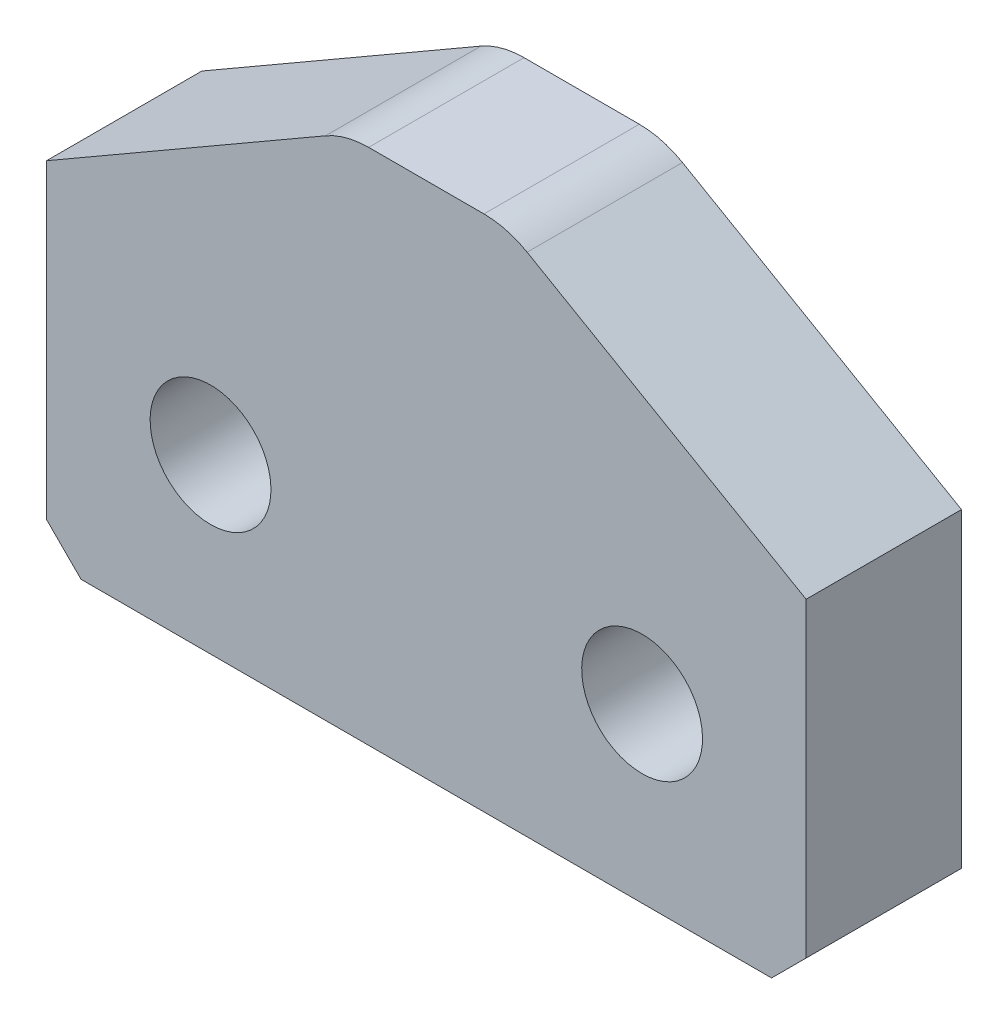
ISO-10303-21;
HEADER;
FILE_DESCRIPTION(('STEP AP214'),'2;1');
FILE_NAME('part.step','',(''),(''),'','','');
FILE_SCHEMA(('AUTOMOTIVE_DESIGN { 1 0 10303 214 1 1 1 1 }'));
ENDSEC;
DATA;
#1=APPLICATION_CONTEXT('core data for automotive mechanical design processes');
#2=APPLICATION_PROTOCOL_DEFINITION('international standard','automotive_design',2000,#1);
#3=PRODUCT_CONTEXT('',#1,'mechanical');
#4=PRODUCT('Part','Part','',(#3));
#5=PRODUCT_RELATED_PRODUCT_CATEGORY('part','',(#4));
#6=PRODUCT_DEFINITION_FORMATION('','',#4);
#7=PRODUCT_DEFINITION_CONTEXT('part definition',#1,'design');
#8=PRODUCT_DEFINITION('design','',#6,#7);
#9=PRODUCT_DEFINITION_SHAPE('','',#8);
#10=(LENGTH_UNIT() NAMED_UNIT(*) SI_UNIT(.MILLI.,.METRE.));
#11=(NAMED_UNIT(*) PLANE_ANGLE_UNIT() SI_UNIT($,.RADIAN.));
#12=(NAMED_UNIT(*) SI_UNIT($,.STERADIAN.) SOLID_ANGLE_UNIT());
#13=UNCERTAINTY_MEASURE_WITH_UNIT(LENGTH_MEASURE(1.E-05),#10,'distance_accuracy_value','');
#14=(GEOMETRIC_REPRESENTATION_CONTEXT(3) GLOBAL_UNCERTAINTY_ASSIGNED_CONTEXT((#13)) GLOBAL_UNIT_ASSIGNED_CONTEXT((#10,
#11,#12)) REPRESENTATION_CONTEXT('',''));
#15=CARTESIAN_POINT('',(0.,0.,0.));
#16=DIRECTION('',(0.,0.,1.));
#17=DIRECTION('',(1.,0.,0.));
#18=AXIS2_PLACEMENT_3D('',#15,#16,#17);
#19=CARTESIAN_POINT('',(15.8397459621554,15.,9.));
#20=DIRECTION('',(0.,0.,1.));
#21=DIRECTION('',(0.,-1.,0.));
#22=AXIS2_PLACEMENT_3D('',#19,#20,#21);
#23=PLANE('',#22);
#24=CARTESIAN_POINT('',(0.,0.,9.));
#25=DIRECTION('',(0.,0.,1.));
#26=DIRECTION('',(0.,-1.,0.));
#27=AXIS2_PLACEMENT_3D('',#24,#25,#26);
#28=CIRCLE('',#27,3.5);
#29=CARTESIAN_POINT('',(0.,-3.5,9.));
#30=VERTEX_POINT('',#29);
#31=EDGE_CURVE('E105',#30,#30,#28,.T.);
#32=ORIENTED_EDGE('',*,*,#31,.F.);
#33=EDGE_LOOP('',(#32));
#34=FACE_BOUND('',#33,.T.);
#35=DIRECTION('',(1.,0.,0.));
#36=VECTOR('',#35,1.);
#37=CARTESIAN_POINT('',(-7.5,-10.,9.));
#38=LINE('',#37,#36);
#39=CARTESIAN_POINT('',(-7.5,-10.,9.));
#40=VERTEX_POINT('',#39);
#41=CARTESIAN_POINT('',(32.5,-10.,9.));
#42=VERTEX_POINT('',#41);
#43=EDGE_CURVE('E136',#40,#42,#38,.T.);
#44=ORIENTED_EDGE('',*,*,#43,.T.);
#45=DIRECTION('',(-0.707106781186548,-0.707106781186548,0.));
#46=VECTOR('',#45,1.);
#47=CARTESIAN_POINT('',(34.5,-8.,9.));
#48=LINE('',#47,#46);
#49=CARTESIAN_POINT('',(34.5,-8.,9.));
#50=VERTEX_POINT('',#49);
#51=EDGE_CURVE('E97',#50,#42,#48,.T.);
#52=ORIENTED_EDGE('',*,*,#51,.F.);
#53=DIRECTION('',(0.,1.,0.));
#54=VECTOR('',#53,1.);
#55=CARTESIAN_POINT('',(34.5,-8.,9.));
#56=LINE('',#55,#54);
#57=CARTESIAN_POINT('',(34.5,10.,9.));
#58=VERTEX_POINT('',#57);
#59=EDGE_CURVE('E139',#50,#58,#56,.T.);
#60=ORIENTED_EDGE('',*,*,#59,.T.);
#61=DIRECTION('',(-0.86602540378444,0.5,0.));
#62=VECTOR('',#61,1.);
#63=CARTESIAN_POINT('',(34.5,10.,9.));
#64=LINE('',#63,#62);
#65=CARTESIAN_POINT('',(18.3397459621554,19.330127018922,9.));
#66=VERTEX_POINT('',#65);
#67=EDGE_CURVE('E142',#58,#66,#64,.T.);
#68=ORIENTED_EDGE('',*,*,#67,.T.);
#69=CARTESIAN_POINT('',(15.8397459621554,15.,9.));
#70=DIRECTION('',(0.,0.,1.));
#71=DIRECTION('',(0.,-1.,0.));
#72=AXIS2_PLACEMENT_3D('',#69,#70,#71);
#73=CIRCLE('',#72,5.);
#74=CARTESIAN_POINT('',(15.8397459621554,20.,9.));
#75=VERTEX_POINT('',#74);
#76=EDGE_CURVE('E145',#66,#75,#73,.T.);
#77=ORIENTED_EDGE('',*,*,#76,.T.);
#78=DIRECTION('',(1.,0.,0.));
#79=VECTOR('',#78,1.);
#80=CARTESIAN_POINT('',(9.16025403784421,20.,9.));
#81=LINE('',#80,#79);
#82=CARTESIAN_POINT('',(9.16025403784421,20.,9.));
#83=VERTEX_POINT('',#82);
#84=EDGE_CURVE('E148',#83,#75,#81,.T.);
#85=ORIENTED_EDGE('',*,*,#84,.F.);
#86=CARTESIAN_POINT('',(9.16025403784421,15.,9.));
#87=DIRECTION('',(0.,0.,1.));
#88=DIRECTION('',(0.,-1.,0.));
#89=AXIS2_PLACEMENT_3D('',#86,#87,#88);
#90=CIRCLE('',#89,5.);
#91=CARTESIAN_POINT('',(6.6602540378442,19.330127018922,9.));
#92=VERTEX_POINT('',#91);
#93=EDGE_CURVE('E151',#83,#92,#90,.T.);
#94=ORIENTED_EDGE('',*,*,#93,.T.);
#95=DIRECTION('',(0.866025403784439,0.5,0.));
#96=VECTOR('',#95,1.);
#97=CARTESIAN_POINT('',(-9.5,10.,9.));
#98=LINE('',#97,#96);
#99=CARTESIAN_POINT('',(-9.5,10.,9.));
#100=VERTEX_POINT('',#99);
#101=EDGE_CURVE('E154',#100,#92,#98,.T.);
#102=ORIENTED_EDGE('',*,*,#101,.F.);
#103=DIRECTION('',(0.,1.,0.));
#104=VECTOR('',#103,1.);
#105=CARTESIAN_POINT('',(-9.5,-8.,9.));
#106=LINE('',#105,#104);
#107=CARTESIAN_POINT('',(-9.5,-8.,9.));
#108=VERTEX_POINT('',#107);
#109=EDGE_CURVE('E157',#108,#100,#106,.T.);
#110=ORIENTED_EDGE('',*,*,#109,.F.);
#111=DIRECTION('',(-0.707106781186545,0.70710678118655,0.));
#112=VECTOR('',#111,1.);
#113=CARTESIAN_POINT('',(-7.5,-10.,9.));
#114=LINE('',#113,#112);
#115=EDGE_CURVE('E159',#40,#108,#114,.T.);
#116=ORIENTED_EDGE('',*,*,#115,.F.);
#117=EDGE_LOOP('',(#44,#52,#60,#68,#77,#85,#94,#102,#110,#116));
#118=FACE_BOUND('',#117,.T.);
#119=CARTESIAN_POINT('',(25.,0.,9.));
#120=DIRECTION('',(0.,0.,1.));
#121=DIRECTION('',(0.,-1.,0.));
#122=AXIS2_PLACEMENT_3D('',#119,#120,#121);
#123=CIRCLE('',#122,3.5);
#124=CARTESIAN_POINT('',(25.,-3.5,9.));
#125=VERTEX_POINT('',#124);
#126=EDGE_CURVE('E329',#125,#125,#123,.T.);
#127=ORIENTED_EDGE('',*,*,#126,.F.);
#128=EDGE_LOOP('',(#127));
#129=FACE_BOUND('',#128,.T.);
#130=ADVANCED_FACE('F14',(#34,#118,#129),#23,.T.);
#131=CARTESIAN_POINT('',(15.8397459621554,15.,0.));
#132=DIRECTION('',(0.,0.,1.));
#133=DIRECTION('',(0.,-1.,0.));
#134=AXIS2_PLACEMENT_3D('',#131,#132,#133);
#135=PLANE('',#134);
#136=CARTESIAN_POINT('',(0.,0.,0.));
#137=DIRECTION('',(0.,0.,1.));
#138=DIRECTION('',(0.,-1.,0.));
#139=AXIS2_PLACEMENT_3D('',#136,#137,#138);
#140=CIRCLE('',#139,3.5);
#141=CARTESIAN_POINT('',(0.,-3.5,0.));
#142=VERTEX_POINT('',#141);
#143=EDGE_CURVE('E334',#142,#142,#140,.T.);
#144=ORIENTED_EDGE('',*,*,#143,.T.);
#145=EDGE_LOOP('',(#144));
#146=FACE_BOUND('',#145,.T.);
#147=DIRECTION('',(1.,0.,0.));
#148=VECTOR('',#147,1.);
#149=CARTESIAN_POINT('',(-7.5,-10.,0.));
#150=LINE('',#149,#148);
#151=CARTESIAN_POINT('',(-7.5,-10.,0.));
#152=VERTEX_POINT('',#151);
#153=CARTESIAN_POINT('',(32.5,-10.,0.));
#154=VERTEX_POINT('',#153);
#155=EDGE_CURVE('E101',#152,#154,#150,.T.);
#156=ORIENTED_EDGE('',*,*,#155,.F.);
#157=DIRECTION('',(-0.707106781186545,0.70710678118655,0.));
#158=VECTOR('',#157,1.);
#159=CARTESIAN_POINT('',(-7.5,-10.,0.));
#160=LINE('',#159,#158);
#161=CARTESIAN_POINT('',(-9.5,-8.,0.));
#162=VERTEX_POINT('',#161);
#163=EDGE_CURVE('E134',#152,#162,#160,.T.);
#164=ORIENTED_EDGE('',*,*,#163,.T.);
#165=DIRECTION('',(0.,1.,0.));
#166=VECTOR('',#165,1.);
#167=CARTESIAN_POINT('',(-9.5,-8.,0.));
#168=LINE('',#167,#166);
#169=CARTESIAN_POINT('',(-9.5,10.,0.));
#170=VERTEX_POINT('',#169);
#171=EDGE_CURVE('E131',#162,#170,#168,.T.);
#172=ORIENTED_EDGE('',*,*,#171,.T.);
#173=DIRECTION('',(0.866025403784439,0.5,0.));
#174=VECTOR('',#173,1.);
#175=CARTESIAN_POINT('',(-9.5,10.,0.));
#176=LINE('',#175,#174);
#177=CARTESIAN_POINT('',(6.6602540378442,19.330127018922,0.));
#178=VERTEX_POINT('',#177);
#179=EDGE_CURVE('E128',#170,#178,#176,.T.);
#180=ORIENTED_EDGE('',*,*,#179,.T.);
#181=CARTESIAN_POINT('',(9.16025403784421,15.,0.));
#182=DIRECTION('',(0.,0.,1.));
#183=DIRECTION('',(0.,-1.,0.));
#184=AXIS2_PLACEMENT_3D('',#181,#182,#183);
#185=CIRCLE('',#184,5.);
#186=CARTESIAN_POINT('',(9.16025403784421,20.,0.));
#187=VERTEX_POINT('',#186);
#188=EDGE_CURVE('E125',#187,#178,#185,.T.);
#189=ORIENTED_EDGE('',*,*,#188,.F.);
#190=DIRECTION('',(1.,0.,0.));
#191=VECTOR('',#190,1.);
#192=CARTESIAN_POINT('',(9.16025403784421,20.,0.));
#193=LINE('',#192,#191);
#194=CARTESIAN_POINT('',(15.8397459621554,20.,0.));
#195=VERTEX_POINT('',#194);
#196=EDGE_CURVE('E122',#187,#195,#193,.T.);
#197=ORIENTED_EDGE('',*,*,#196,.T.);
#198=CARTESIAN_POINT('',(15.8397459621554,15.,0.));
#199=DIRECTION('',(0.,0.,1.));
#200=DIRECTION('',(0.,-1.,0.));
#201=AXIS2_PLACEMENT_3D('',#198,#199,#200);
#202=CIRCLE('',#201,5.);
#203=CARTESIAN_POINT('',(18.3397459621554,19.330127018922,0.));
#204=VERTEX_POINT('',#203);
#205=EDGE_CURVE('E119',#204,#195,#202,.T.);
#206=ORIENTED_EDGE('',*,*,#205,.F.);
#207=DIRECTION('',(-0.86602540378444,0.5,0.));
#208=VECTOR('',#207,1.);
#209=CARTESIAN_POINT('',(34.5,10.,0.));
#210=LINE('',#209,#208);
#211=CARTESIAN_POINT('',(34.5,10.,0.));
#212=VERTEX_POINT('',#211);
#213=EDGE_CURVE('E113',#212,#204,#210,.T.);
#214=ORIENTED_EDGE('',*,*,#213,.F.);
#215=DIRECTION('',(0.,1.,0.));
#216=VECTOR('',#215,1.);
#217=CARTESIAN_POINT('',(34.5,-8.,0.));
#218=LINE('',#217,#216);
#219=CARTESIAN_POINT('',(34.5,-8.,0.));
#220=VERTEX_POINT('',#219);
#221=EDGE_CURVE('E111',#220,#212,#218,.T.);
#222=ORIENTED_EDGE('',*,*,#221,.F.);
#223=DIRECTION('',(-0.707106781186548,-0.707106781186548,0.));
#224=VECTOR('',#223,1.);
#225=CARTESIAN_POINT('',(34.5,-8.,0.));
#226=LINE('',#225,#224);
#227=EDGE_CURVE('E94',#220,#154,#226,.T.);
#228=ORIENTED_EDGE('',*,*,#227,.T.);
#229=EDGE_LOOP('',(#156,#164,#172,#180,#189,#197,#206,#214,#222,#228));
#230=FACE_BOUND('',#229,.T.);
#231=CARTESIAN_POINT('',(25.,0.,0.));
#232=DIRECTION('',(0.,0.,1.));
#233=DIRECTION('',(0.,-1.,0.));
#234=AXIS2_PLACEMENT_3D('',#231,#232,#233);
#235=CIRCLE('',#234,3.5);
#236=CARTESIAN_POINT('',(25.,-3.5,0.));
#237=VERTEX_POINT('',#236);
#238=EDGE_CURVE('E332',#237,#237,#235,.T.);
#239=ORIENTED_EDGE('',*,*,#238,.T.);
#240=EDGE_LOOP('',(#239));
#241=FACE_BOUND('',#240,.T.);
#242=ADVANCED_FACE('F107',(#146,#230,#241),#135,.F.);
#243=CARTESIAN_POINT('',(-7.5,-10.,9.));
#244=DIRECTION('',(0.,1.,0.));
#245=DIRECTION('',(0.,0.,1.));
#246=AXIS2_PLACEMENT_3D('',#243,#244,#245);
#247=PLANE('',#246);
#248=DIRECTION('',(0.,0.,-1.));
#249=VECTOR('',#248,1.);
#250=CARTESIAN_POINT('',(32.5,-10.,9.));
#251=LINE('',#250,#249);
#252=EDGE_CURVE('E9',#42,#154,#251,.T.);
#253=ORIENTED_EDGE('',*,*,#252,.F.);
#254=ORIENTED_EDGE('',*,*,#43,.F.);
#255=DIRECTION('',(0.,0.,-1.));
#256=VECTOR('',#255,1.);
#257=CARTESIAN_POINT('',(-7.5,-10.,9.));
#258=LINE('',#257,#256);
#259=EDGE_CURVE('E29',#40,#152,#258,.T.);
#260=ORIENTED_EDGE('',*,*,#259,.T.);
#261=ORIENTED_EDGE('',*,*,#155,.T.);
#262=EDGE_LOOP('',(#253,#254,#260,#261));
#263=FACE_BOUND('',#262,.T.);
#264=ADVANCED_FACE('F102',(#263),#247,.F.);
#265=CARTESIAN_POINT('',(34.5,-8.,9.));
#266=DIRECTION('',(0.707106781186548,-0.707106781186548,0.));
#267=DIRECTION('',(0.707106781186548,0.707106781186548,0.));
#268=AXIS2_PLACEMENT_3D('',#265,#266,#267);
#269=PLANE('',#268);
#270=DIRECTION('',(0.,0.,-1.));
#271=VECTOR('',#270,1.);
#272=CARTESIAN_POINT('',(34.5,-8.,9.));
#273=LINE('',#272,#271);
#274=EDGE_CURVE('E22',#50,#220,#273,.T.);
#275=ORIENTED_EDGE('',*,*,#274,.F.);
#276=ORIENTED_EDGE('',*,*,#51,.T.);
#277=ORIENTED_EDGE('',*,*,#252,.T.);
#278=ORIENTED_EDGE('',*,*,#227,.F.);
#279=EDGE_LOOP('',(#275,#276,#277,#278));
#280=FACE_BOUND('',#279,.T.);
#281=ADVANCED_FACE('F16',(#280),#269,.T.);
#282=CARTESIAN_POINT('',(34.5,-8.,9.));
#283=DIRECTION('',(-1.,0.,0.));
#284=DIRECTION('',(0.,0.,-1.));
#285=AXIS2_PLACEMENT_3D('',#282,#283,#284);
#286=PLANE('',#285);
#287=DIRECTION('',(0.,0.,-1.));
#288=VECTOR('',#287,1.);
#289=CARTESIAN_POINT('',(34.5,10.,9.));
#290=LINE('',#289,#288);
#291=EDGE_CURVE('E173',#58,#212,#290,.T.);
#292=ORIENTED_EDGE('',*,*,#291,.F.);
#293=ORIENTED_EDGE('',*,*,#59,.F.);
#294=ORIENTED_EDGE('',*,*,#274,.T.);
#295=ORIENTED_EDGE('',*,*,#221,.T.);
#296=EDGE_LOOP('',(#292,#293,#294,#295));
#297=FACE_BOUND('',#296,.T.);
#298=ADVANCED_FACE('F176',(#297),#286,.F.);
#299=CARTESIAN_POINT('',(34.5,10.,9.));
#300=DIRECTION('',(-0.5,-0.86602540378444,0.));
#301=DIRECTION('',(0.86602540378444,-0.5,0.));
#302=AXIS2_PLACEMENT_3D('',#299,#300,#301);
#303=PLANE('',#302);
#304=DIRECTION('',(0.,0.,-1.));
#305=VECTOR('',#304,1.);
#306=CARTESIAN_POINT('',(18.3397459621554,19.330127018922,9.));
#307=LINE('',#306,#305);
#308=EDGE_CURVE('E171',#66,#204,#307,.T.);
#309=ORIENTED_EDGE('',*,*,#308,.F.);
#310=ORIENTED_EDGE('',*,*,#67,.F.);
#311=ORIENTED_EDGE('',*,*,#291,.T.);
#312=ORIENTED_EDGE('',*,*,#213,.T.);
#313=EDGE_LOOP('',(#309,#310,#311,#312));
#314=FACE_BOUND('',#313,.T.);
#315=ADVANCED_FACE('F200',(#314),#303,.F.);
#316=CARTESIAN_POINT('',(15.8397459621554,15.,9.));
#317=DIRECTION('',(0.,0.,-1.));
#318=DIRECTION('',(0.,1.,0.));
#319=AXIS2_PLACEMENT_3D('',#316,#317,#318);
#320=CYLINDRICAL_SURFACE('',#319,5.);
#321=DIRECTION('',(0.,0.,-1.));
#322=VECTOR('',#321,1.);
#323=CARTESIAN_POINT('',(15.8397459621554,20.,9.));
#324=LINE('',#323,#322);
#325=EDGE_CURVE('E169',#75,#195,#324,.T.);
#326=ORIENTED_EDGE('',*,*,#325,.F.);
#327=ORIENTED_EDGE('',*,*,#76,.F.);
#328=ORIENTED_EDGE('',*,*,#308,.T.);
#329=ORIENTED_EDGE('',*,*,#205,.T.);
#330=EDGE_LOOP('',(#326,#327,#328,#329));
#331=FACE_BOUND('',#330,.T.);
#332=ADVANCED_FACE('F197',(#331),#320,.T.);
#333=CARTESIAN_POINT('',(9.16025403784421,20.,9.));
#334=DIRECTION('',(0.,1.,0.));
#335=DIRECTION('',(-1.,0.,0.));
#336=AXIS2_PLACEMENT_3D('',#333,#334,#335);
#337=PLANE('',#336);
#338=DIRECTION('',(0.,0.,-1.));
#339=VECTOR('',#338,1.);
#340=CARTESIAN_POINT('',(9.16025403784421,20.,9.));
#341=LINE('',#340,#339);
#342=EDGE_CURVE('E167',#83,#187,#341,.T.);
#343=ORIENTED_EDGE('',*,*,#342,.F.);
#344=ORIENTED_EDGE('',*,*,#84,.T.);
#345=ORIENTED_EDGE('',*,*,#325,.T.);
#346=ORIENTED_EDGE('',*,*,#196,.F.);
#347=EDGE_LOOP('',(#343,#344,#345,#346));
#348=FACE_BOUND('',#347,.T.);
#349=ADVANCED_FACE('F194',(#348),#337,.T.);
#350=CARTESIAN_POINT('',(9.16025403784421,15.,9.));
#351=DIRECTION('',(0.,0.,-1.));
#352=DIRECTION('',(0.,1.,0.));
#353=AXIS2_PLACEMENT_3D('',#350,#351,#352);
#354=CYLINDRICAL_SURFACE('',#353,5.);
#355=DIRECTION('',(0.,0.,-1.));
#356=VECTOR('',#355,1.);
#357=CARTESIAN_POINT('',(6.6602540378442,19.330127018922,9.));
#358=LINE('',#357,#356);
#359=EDGE_CURVE('E165',#92,#178,#358,.T.);
#360=ORIENTED_EDGE('',*,*,#359,.F.);
#361=ORIENTED_EDGE('',*,*,#93,.F.);
#362=ORIENTED_EDGE('',*,*,#342,.T.);
#363=ORIENTED_EDGE('',*,*,#188,.T.);
#364=EDGE_LOOP('',(#360,#361,#362,#363));
#365=FACE_BOUND('',#364,.T.);
#366=ADVANCED_FACE('F190',(#365),#354,.T.);
#367=CARTESIAN_POINT('',(-9.5,10.,9.));
#368=DIRECTION('',(-0.5,0.866025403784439,0.));
#369=DIRECTION('',(-0.866025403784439,-0.5,0.));
#370=AXIS2_PLACEMENT_3D('',#367,#368,#369);
#371=PLANE('',#370);
#372=DIRECTION('',(0.,0.,-1.));
#373=VECTOR('',#372,1.);
#374=CARTESIAN_POINT('',(-9.5,10.,9.));
#375=LINE('',#374,#373);
#376=EDGE_CURVE('E163',#100,#170,#375,.T.);
#377=ORIENTED_EDGE('',*,*,#376,.F.);
#378=ORIENTED_EDGE('',*,*,#101,.T.);
#379=ORIENTED_EDGE('',*,*,#359,.T.);
#380=ORIENTED_EDGE('',*,*,#179,.F.);
#381=EDGE_LOOP('',(#377,#378,#379,#380));
#382=FACE_BOUND('',#381,.T.);
#383=ADVANCED_FACE('F187',(#382),#371,.T.);
#384=CARTESIAN_POINT('',(-9.5,-8.,9.));
#385=DIRECTION('',(-1.,0.,0.));
#386=DIRECTION('',(0.,0.,-1.));
#387=AXIS2_PLACEMENT_3D('',#384,#385,#386);
#388=PLANE('',#387);
#389=DIRECTION('',(0.,0.,-1.));
#390=VECTOR('',#389,1.);
#391=CARTESIAN_POINT('',(-9.5,-8.,9.));
#392=LINE('',#391,#390);
#393=EDGE_CURVE('E37',#108,#162,#392,.T.);
#394=ORIENTED_EDGE('',*,*,#393,.F.);
#395=ORIENTED_EDGE('',*,*,#109,.T.);
#396=ORIENTED_EDGE('',*,*,#376,.T.);
#397=ORIENTED_EDGE('',*,*,#171,.F.);
#398=EDGE_LOOP('',(#394,#395,#396,#397));
#399=FACE_BOUND('',#398,.T.);
#400=ADVANCED_FACE('F183',(#399),#388,.T.);
#401=CARTESIAN_POINT('',(-7.5,-10.,9.));
#402=DIRECTION('',(-0.70710678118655,-0.707106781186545,0.));
#403=DIRECTION('',(0.707106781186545,-0.70710678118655,0.));
#404=AXIS2_PLACEMENT_3D('',#401,#402,#403);
#405=PLANE('',#404);
#406=ORIENTED_EDGE('',*,*,#115,.T.);
#407=ORIENTED_EDGE('',*,*,#393,.T.);
#408=ORIENTED_EDGE('',*,*,#163,.F.);
#409=ORIENTED_EDGE('',*,*,#259,.F.);
#410=EDGE_LOOP('',(#406,#407,#408,#409));
#411=FACE_BOUND('',#410,.T.);
#412=ADVANCED_FACE('F182',(#411),#405,.T.);
#413=CARTESIAN_POINT('',(0.,0.,9.));
#414=DIRECTION('',(0.,0.,-1.));
#415=DIRECTION('',(0.,1.,0.));
#416=AXIS2_PLACEMENT_3D('',#413,#414,#415);
#417=CYLINDRICAL_SURFACE('',#416,3.5);
#418=ORIENTED_EDGE('',*,*,#31,.T.);
#419=EDGE_LOOP('',(#418));
#420=FACE_BOUND('',#419,.T.);
#421=ORIENTED_EDGE('',*,*,#143,.F.);
#422=EDGE_LOOP('',(#421));
#423=FACE_BOUND('',#422,.T.);
#424=ADVANCED_FACE('F226',(#420,#423),#417,.F.);
#425=CARTESIAN_POINT('',(25.,0.,9.));
#426=DIRECTION('',(0.,0.,-1.));
#427=DIRECTION('',(0.,1.,0.));
#428=AXIS2_PLACEMENT_3D('',#425,#426,#427);
#429=CYLINDRICAL_SURFACE('',#428,3.5);
#430=ORIENTED_EDGE('',*,*,#126,.T.);
#431=EDGE_LOOP('',(#430));
#432=FACE_BOUND('',#431,.T.);
#433=ORIENTED_EDGE('',*,*,#238,.F.);
#434=EDGE_LOOP('',(#433));
#435=FACE_BOUND('',#434,.T.);
#436=ADVANCED_FACE('F271',(#432,#435),#429,.F.);
#437=CLOSED_SHELL('',(#130,#242,#264,#281,#298,#315,#332,#349,#366,#383,#400,#412,#424,#436));
#438=MANIFOLD_SOLID_BREP('B1',#437);
#439=ADVANCED_BREP_SHAPE_REPRESENTATION('',(#18,#438),#14);
#440=SHAPE_DEFINITION_REPRESENTATION(#9,#439);
ENDSEC;
END-ISO-10303-21;
